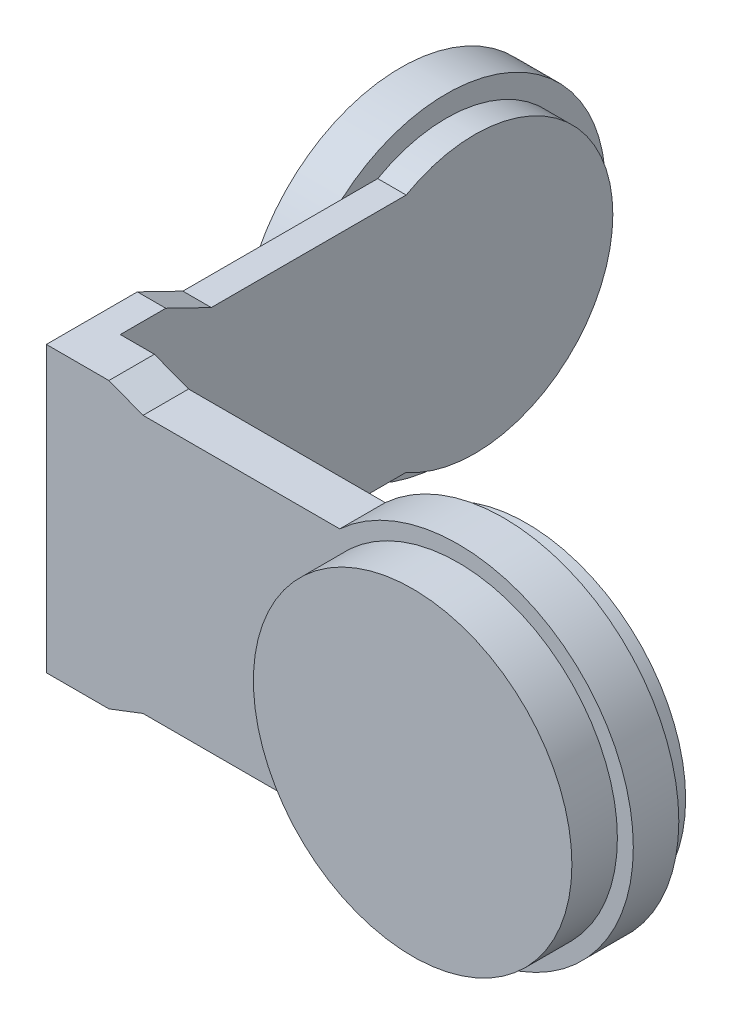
from build123d import *

# Parameters (mm, degrees)
SKETCH2_R           = 14
BOSS_EXTRUDE1_DEPTH = 4
BOSS_EXTRUDE2_DEPTH = 2.5
BOSS_EXTRUDE3_DEPTH = 4
SKETCH5_R           = 14
BOSS_EXTRUDE4_DEPTH = 4
BOSS_EXTRUDE5_START = 2
SKETCH6_R           = 14
BOSS_EXTRUDE5_DEPTH = 2


with BuildPart() as part:
    # Sketch2 → Boss-Extrude1 (new body)
    with BuildSketch(Plane(origin=(0, 0, 0), x_dir=(0, 0, -1), z_dir=(1, 0, 0))):
        Circle(SKETCH2_R)
    extrude(amount=BOSS_EXTRUDE1_DEPTH)

    # Sketch3 → Boss-Extrude2 (add)
    with BuildSketch(Plane(origin=(4, 0, 0), x_dir=(0, 0, -1), z_dir=(1, 0, 0))):
        with BuildLine():
            Line((-35.15, 12.5), (-35.15, -12.5))
            Line((-35.15, -12.5), (-27.15, -12.5))
            Line((-27.15, -12.5), (-23.15, -10.555257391))
            Line((-23.15, -10.555257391), (-6.017394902, -10.555257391))
            ThreePointArc((-6.017394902, -10.555257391), (12.15, 0), (-6.017394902, 10.555257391))
            Line((-6.017394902, 10.555257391), (-23.15, 10.555257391))
            Line((-23.15, 10.555257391), (-27.15, 12.5))
            Line((-27.15, 12.5), (-35.15, 12.5))
        make_face()
    extrude(amount=BOSS_EXTRUDE2_DEPTH)

    # Sketch4 → Boss-Extrude3 (add)
    with BuildSketch(Plane.XY.offset(35.15)):
        with BuildLine():
            Line((12.5, -11.35), (29.791469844, -11.35))
            ThreePointArc((29.791469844, -11.35), (55.6, 0), (29.791469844, 11.35))
            Line((29.791469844, 11.35), (12.5, 11.35))
            Line((12.5, 11.35), (9.5, 12.5))
            Line((9.5, 12.5), (6.5, 12.5))
            Line((6.5, 12.5), (6.5, -12.5))
            Line((6.5, -12.5), (9.5, -12.5))
            Line((9.5, -12.5), (12.5, -11.35))
        make_face()
    extrude(amount=-BOSS_EXTRUDE3_DEPTH)

    # Sketch5 → Boss-Extrude4 (add)
    with BuildSketch(Plane.XY.offset(35.15)):
        with Locations((40.2, 0)):
            Circle(SKETCH5_R)
    extrude(amount=BOSS_EXTRUDE4_DEPTH)

    # Sketch6 → Boss-Extrude5 (add)
    with BuildSketch(Plane(origin=(0, 0, 31.15), x_dir=(-1, 0, 0), z_dir=(0, 0, -1)).offset(BOSS_EXTRUDE5_START)):
        with Locations(Location((-40.2, 0, 0), (0, 0, 180))):
            Circle(SKETCH6_R)
    extrude(amount=-BOSS_EXTRUDE5_DEPTH)


solid = part.part
